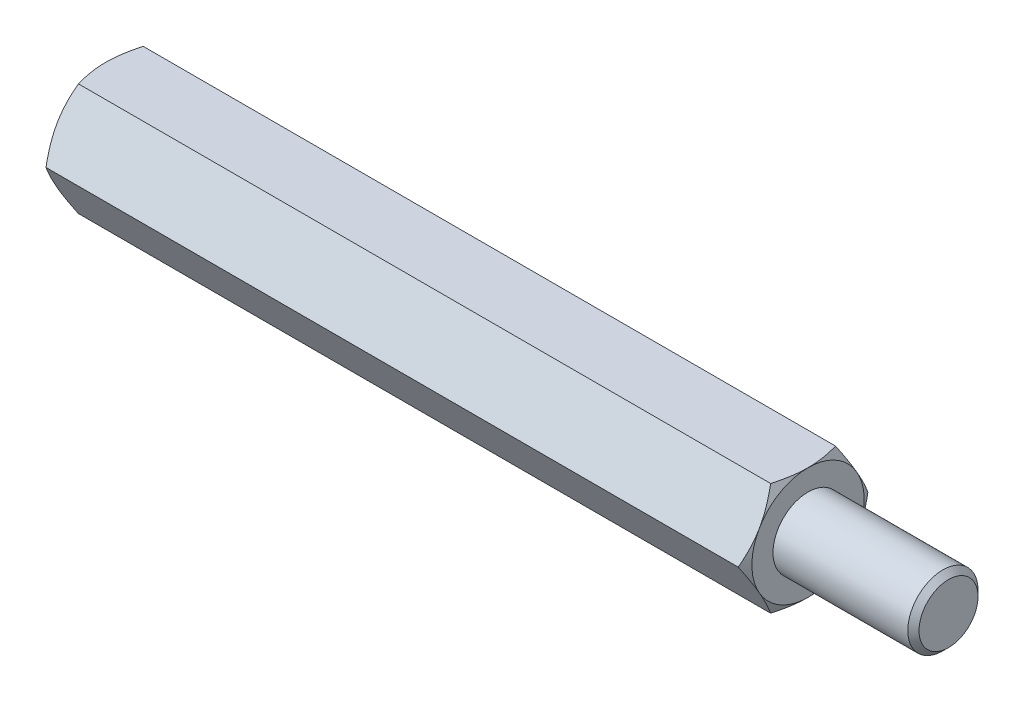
from build123d import *

# Parameters (mm, degrees)
EXTRUDE2_DEPTH = 25
SKETCH3_R      = 2.1
EXTRUDE3_DEPTH = 10
SKETCH5_R      = 2.5
EXTRUDE4_DEPTH = 10
CHAMFER1_SIZE  = 0.4


with BuildPart() as part:
    # Sketch1 → Extrude2 (new, symmetric)
    with BuildSketch(Plane(origin=(0, 0, 0), x_dir=(0, 0, -1), z_dir=(1, 0, 0))):
        Polygon((2.309401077, 4), (-2.309401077, 4), (-4.618802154, 0), (-2.309401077, -4), (2.309401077, -4), (4.618802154, 0), align=None)
    extrude(amount=EXTRUDE2_DEPTH, both=True)

    # Sketch2 → Cut-Revolve1 (revolve, cut)
    with BuildSketch(Plane.XY):
        with BuildLine():
            Line((-25, 4), (-23.5, 6.598076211))
            ThreePointArc((-23.5, 6.598076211), (-23.98810136, 7.776457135), (-25, 7))
            Line((-25, 7), (-25, 4))
        make_face()
    cut_revolve1 = revolve(axis=Axis((0, 0, 0), (1, 0, 0)), mode=Mode.SUBTRACT)

    # Mirror1: Cut-Revolve1 across plane
    add(cut_revolve1.mirror(Plane(origin=(0, 0, 0), x_dir=(0, 0, 1), z_dir=(1, 0, 0))), mode=Mode.SUBTRACT)

    # Sketch3 → Extrude3 (cut)
    with BuildSketch(Plane.ZY.offset(25)):
        Circle(SKETCH3_R)
    extrude(amount=-EXTRUDE3_DEPTH, mode=Mode.SUBTRACT)

    # Sketch4 → Cut-Revolve2 (revolve, cut)
    with BuildSketch(Plane.XY, mode=Mode.PRIVATE) as cut_revolve2_sk:
        Polygon((-15, 0), (-15, 2.1), (-13.787564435, 0), align=None)
    revolve(cut_revolve2_sk.sketch.rotate(Axis((-13.787564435, 0, 0), (-1, 0, 0)), 270), axis=Axis((-13.787564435, 0, 0), (-1, 0, 0)), mode=Mode.SUBTRACT)

    # Sketch5 → Extrude4 (add)
    with BuildSketch(Plane(origin=(25, 0, 0), x_dir=(0, 0, -1), z_dir=(1, 0, 0))):
        Circle(SKETCH5_R)
    extrude(amount=EXTRUDE4_DEPTH)

    # Chamfer1
    chamfer1_edges = [part.edges().sort_by_distance(p)[0] for p in [
        (35, 0, 2.5),
    ]]
    chamfer(chamfer1_edges, length=CHAMFER1_SIZE)


solid = part.part
